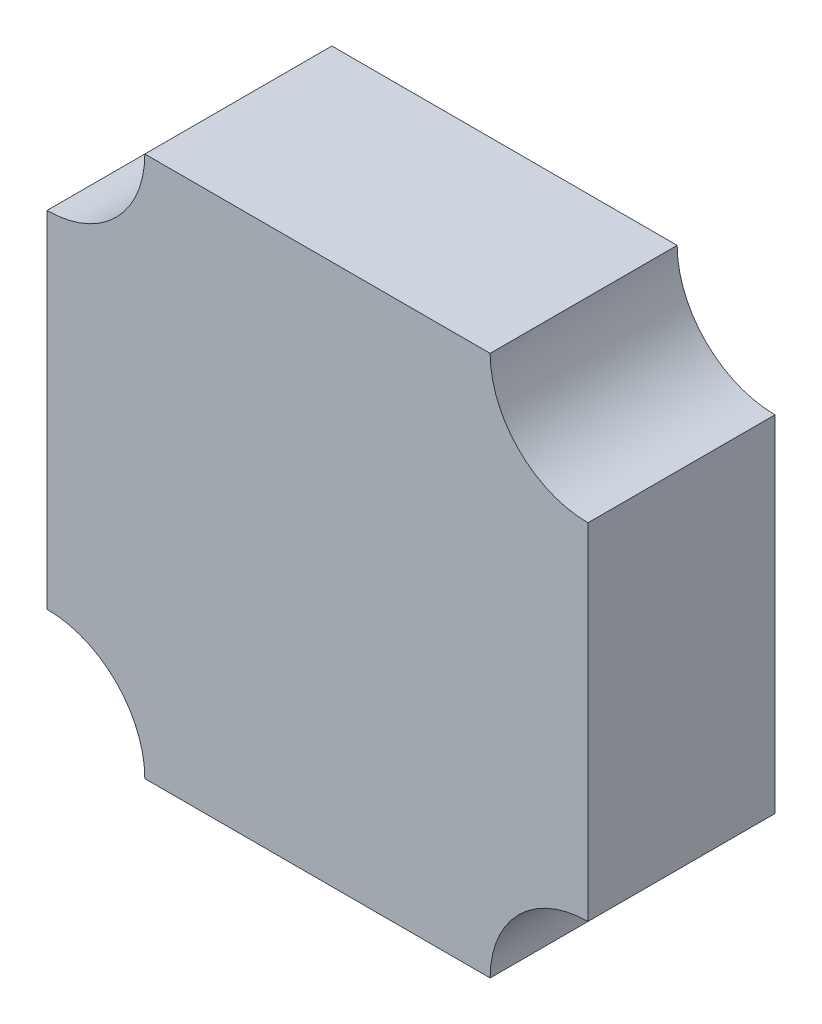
from build123d import *

# Parameters (mm, degrees)
EXTRUDE_1_DEPTH = 19.5


with BuildPart() as part:
    # Sketch 1 → Extrude 1 (new body)
    with BuildSketch(Plane.XY):
        with BuildLine():
            Line((18, -28.2), (-18, -28.2))
            ThreePointArc((-18, -28.2), (-20.987510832, -20.987510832), (-28.2, -18))
            Line((-28.2, -18), (-28.2, 18))
            ThreePointArc((-28.2, 18), (-20.987510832, 20.987510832), (-18, 28.2))
            Line((-18, 28.2), (18, 28.2))
            ThreePointArc((18, 28.2), (20.987510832, 20.987510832), (28.2, 18))
            Line((28.2, 18), (28.2, -18))
            ThreePointArc((28.2, -18), (20.987510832, -20.987510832), (18, -28.2))
        make_face()
    extrude(amount=EXTRUDE_1_DEPTH)


solid = part.part
